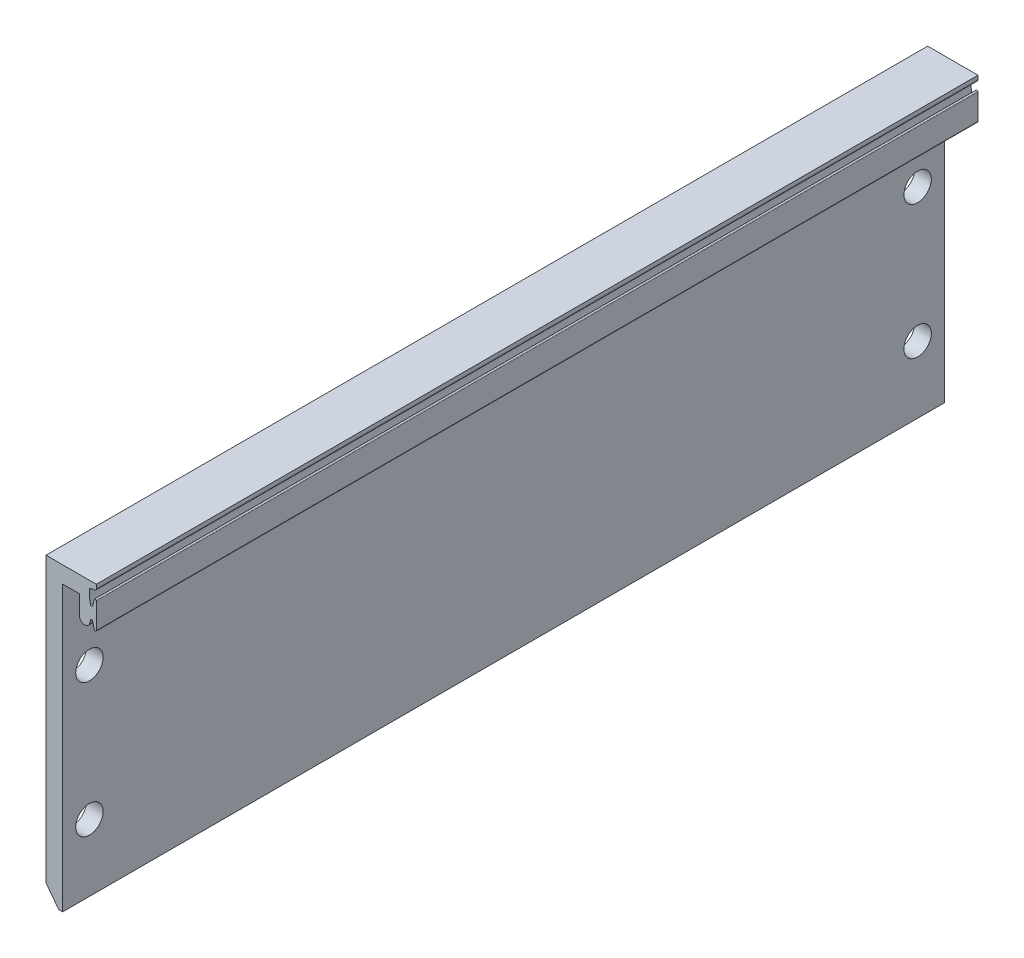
ISO-10303-21;
HEADER;
FILE_DESCRIPTION(('STEP AP214'),'2;1');
FILE_NAME('part.step','',(''),(''),'','','');
FILE_SCHEMA(('AUTOMOTIVE_DESIGN { 1 0 10303 214 1 1 1 1 }'));
ENDSEC;
DATA;
#1=APPLICATION_CONTEXT('core data for automotive mechanical design processes');
#2=APPLICATION_PROTOCOL_DEFINITION('international standard','automotive_design',2000,#1);
#3=PRODUCT_CONTEXT('',#1,'mechanical');
#4=PRODUCT('Part','Part','',(#3));
#5=PRODUCT_RELATED_PRODUCT_CATEGORY('part','',(#4));
#6=PRODUCT_DEFINITION_FORMATION('','',#4);
#7=PRODUCT_DEFINITION_CONTEXT('part definition',#1,'design');
#8=PRODUCT_DEFINITION('design','',#6,#7);
#9=PRODUCT_DEFINITION_SHAPE('','',#8);
#10=(LENGTH_UNIT() NAMED_UNIT(*) SI_UNIT(.MILLI.,.METRE.));
#11=(NAMED_UNIT(*) PLANE_ANGLE_UNIT() SI_UNIT($,.RADIAN.));
#12=(NAMED_UNIT(*) SI_UNIT($,.STERADIAN.) SOLID_ANGLE_UNIT());
#13=UNCERTAINTY_MEASURE_WITH_UNIT(LENGTH_MEASURE(1.E-05),#10,'distance_accuracy_value','');
#14=(GEOMETRIC_REPRESENTATION_CONTEXT(3) GLOBAL_UNCERTAINTY_ASSIGNED_CONTEXT((#13)) GLOBAL_UNIT_ASSIGNED_CONTEXT((#10,
#11,#12)) REPRESENTATION_CONTEXT('',''));
#15=CARTESIAN_POINT('',(0.,0.,0.));
#16=DIRECTION('',(0.,0.,1.));
#17=DIRECTION('',(1.,0.,0.));
#18=AXIS2_PLACEMENT_3D('',#15,#16,#17);
#19=CARTESIAN_POINT('',(540.829442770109,-3340.4171465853,66.));
#20=DIRECTION('',(-0.159823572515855,0.987145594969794,0.));
#21=DIRECTION('',(-0.987145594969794,-0.159823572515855,0.));
#22=AXIS2_PLACEMENT_3D('',#19,#20,#21);
#23=PLANE('',#22);
#24=DIRECTION('',(0.987145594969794,0.159823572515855,0.));
#25=VECTOR('',#24,1.);
#26=CARTESIAN_POINT('',(540.829442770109,-3340.4171465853,-66.));
#27=LINE('',#26,#25);
#28=CARTESIAN_POINT('',(2261.93990029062,-3061.76116775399,-66.));
#29=VERTEX_POINT('',#28);
#30=CARTESIAN_POINT('',(2262.48897943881,-3061.67226922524,-66.));
#31=VERTEX_POINT('',#30);
#32=EDGE_CURVE('E215',#29,#31,#27,.T.);
#33=ORIENTED_EDGE('',*,*,#32,.T.);
#34=DIRECTION('',(0.,0.,-1.));
#35=VECTOR('',#34,1.);
#36=CARTESIAN_POINT('',(2262.48897943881,-3061.67226922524,66.));
#37=LINE('',#36,#35);
#38=CARTESIAN_POINT('',(2262.48897943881,-3061.67226922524,66.));
#39=VERTEX_POINT('',#38);
#40=EDGE_CURVE('E11',#39,#31,#37,.T.);
#41=ORIENTED_EDGE('',*,*,#40,.F.);
#42=DIRECTION('',(0.987145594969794,0.159823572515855,0.));
#43=VECTOR('',#42,1.);
#44=CARTESIAN_POINT('',(540.829442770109,-3340.4171465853,66.));
#45=LINE('',#44,#43);
#46=CARTESIAN_POINT('',(2261.93990029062,-3061.76116775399,66.));
#47=VERTEX_POINT('',#46);
#48=EDGE_CURVE('E263',#47,#39,#45,.T.);
#49=ORIENTED_EDGE('',*,*,#48,.F.);
#50=DIRECTION('',(0.,0.,-1.));
#51=VECTOR('',#50,1.);
#52=CARTESIAN_POINT('',(2261.93990029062,-3061.76116775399,66.));
#53=LINE('',#52,#51);
#54=EDGE_CURVE('E57',#47,#29,#53,.T.);
#55=ORIENTED_EDGE('',*,*,#54,.T.);
#56=EDGE_LOOP('',(#33,#41,#49,#55));
#57=FACE_BOUND('',#56,.T.);
#58=ADVANCED_FACE('F39',(#57),#23,.F.);
#59=CARTESIAN_POINT('',(2262.44103236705,-3061.37612554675,66.));
#60=DIRECTION('',(0.,0.,-1.));
#61=DIRECTION('',(-1.,0.,0.));
#62=AXIS2_PLACEMENT_3D('',#59,#60,#61);
#63=CYLINDRICAL_SURFACE('',#62,0.300000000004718);
#64=CARTESIAN_POINT('',(2262.44103236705,-3061.37612554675,-66.));
#65=DIRECTION('',(0.,0.,1.));
#66=DIRECTION('',(1.,0.,0.));
#67=AXIS2_PLACEMENT_3D('',#64,#65,#66);
#68=CIRCLE('',#67,0.300000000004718);
#69=CARTESIAN_POINT('',(2262.74103236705,-3061.37612554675,-66.));
#70=VERTEX_POINT('',#69);
#71=EDGE_CURVE('E217',#31,#70,#68,.T.);
#72=ORIENTED_EDGE('',*,*,#71,.T.);
#73=DIRECTION('',(0.,0.,-1.));
#74=VECTOR('',#73,1.);
#75=CARTESIAN_POINT('',(2262.74103236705,-3061.37612554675,66.));
#76=LINE('',#75,#74);
#77=CARTESIAN_POINT('',(2262.74103236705,-3061.37612554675,66.));
#78=VERTEX_POINT('',#77);
#79=EDGE_CURVE('E48',#78,#70,#76,.T.);
#80=ORIENTED_EDGE('',*,*,#79,.F.);
#81=CARTESIAN_POINT('',(2262.44103236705,-3061.37612554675,66.));
#82=DIRECTION('',(0.,0.,1.));
#83=DIRECTION('',(1.,0.,0.));
#84=AXIS2_PLACEMENT_3D('',#81,#82,#83);
#85=CIRCLE('',#84,0.300000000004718);
#86=EDGE_CURVE('E134',#39,#78,#85,.T.);
#87=ORIENTED_EDGE('',*,*,#86,.F.);
#88=ORIENTED_EDGE('',*,*,#40,.T.);
#89=EDGE_LOOP('',(#72,#80,#87,#88));
#90=FACE_BOUND('',#89,.T.);
#91=ADVANCED_FACE('F389',(#90),#63,.T.);
#92=CARTESIAN_POINT('',(2262.74103237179,-3.49719947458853E-09,66.));
#93=DIRECTION('',(1.,-1.54555887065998E-12,0.));
#94=DIRECTION('',(1.54555887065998E-12,1.,0.));
#95=AXIS2_PLACEMENT_3D('',#92,#93,#94);
#96=PLANE('',#95);
#97=DIRECTION('',(-1.54555887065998E-12,-1.,0.));
#98=VECTOR('',#97,1.);
#99=CARTESIAN_POINT('',(2262.74103237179,-3.49719947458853E-09,-66.));
#100=LINE('',#99,#98);
#101=CARTESIAN_POINT('',(2262.74103236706,-3060.80146065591,-66.));
#102=VERTEX_POINT('',#101);
#103=EDGE_CURVE('E221',#102,#70,#100,.T.);
#104=ORIENTED_EDGE('',*,*,#103,.F.);
#105=DIRECTION('',(0.,0.,-1.));
#106=VECTOR('',#105,1.);
#107=CARTESIAN_POINT('',(2262.74103236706,-3060.80146065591,66.));
#108=LINE('',#107,#106);
#109=CARTESIAN_POINT('',(2262.74103236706,-3060.80146065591,66.));
#110=VERTEX_POINT('',#109);
#111=EDGE_CURVE('E307',#110,#102,#108,.T.);
#112=ORIENTED_EDGE('',*,*,#111,.F.);
#113=DIRECTION('',(-1.54555887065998E-12,-1.,0.));
#114=VECTOR('',#113,1.);
#115=CARTESIAN_POINT('',(2262.74103237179,-3.49719947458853E-09,66.));
#116=LINE('',#115,#114);
#117=EDGE_CURVE('E335',#110,#78,#116,.T.);
#118=ORIENTED_EDGE('',*,*,#117,.T.);
#119=ORIENTED_EDGE('',*,*,#79,.T.);
#120=EDGE_LOOP('',(#104,#112,#118,#119));
#121=FACE_BOUND('',#120,.T.);
#122=ADVANCED_FACE('F393',(#121),#96,.T.);
#123=CARTESIAN_POINT('',(1.80274390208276E-10,-3060.80146065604,66.));
#124=DIRECTION('',(0.,-1.,0.));
#125=DIRECTION('',(1.,0.,0.));
#126=AXIS2_PLACEMENT_3D('',#123,#124,#125);
#127=PLANE('',#126);
#128=DIRECTION('',(-1.,0.,0.));
#129=VECTOR('',#128,1.);
#130=CARTESIAN_POINT('',(1.80274390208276E-10,-3060.80146065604,-66.));
#131=LINE('',#130,#129);
#132=CARTESIAN_POINT('',(2255.20103236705,-3060.80146065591,-66.));
#133=VERTEX_POINT('',#132);
#134=EDGE_CURVE('E224',#102,#133,#131,.T.);
#135=ORIENTED_EDGE('',*,*,#134,.T.);
#136=DIRECTION('',(0.,0.,-1.));
#137=VECTOR('',#136,1.);
#138=CARTESIAN_POINT('',(2255.20103236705,-3060.80146065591,66.));
#139=LINE('',#138,#137);
#140=CARTESIAN_POINT('',(2255.20103236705,-3060.80146065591,66.));
#141=VERTEX_POINT('',#140);
#142=EDGE_CURVE('E304',#141,#133,#139,.T.);
#143=ORIENTED_EDGE('',*,*,#142,.F.);
#144=DIRECTION('',(-1.,0.,0.));
#145=VECTOR('',#144,1.);
#146=CARTESIAN_POINT('',(1.80274390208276E-10,-3060.80146065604,66.));
#147=LINE('',#146,#145);
#148=EDGE_CURVE('E338',#110,#141,#147,.T.);
#149=ORIENTED_EDGE('',*,*,#148,.F.);
#150=ORIENTED_EDGE('',*,*,#111,.T.);
#151=EDGE_LOOP('',(#135,#143,#149,#150));
#152=FACE_BOUND('',#151,.T.);
#153=ADVANCED_FACE('F405',(#152),#127,.F.);
#154=CARTESIAN_POINT('',(2255.20103236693,9.42598065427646E-11,66.));
#155=DIRECTION('',(1.,0.,0.));
#156=DIRECTION('',(0.,1.,0.));
#157=AXIS2_PLACEMENT_3D('',#154,#155,#156);
#158=PLANE('',#157);
#159=CARTESIAN_POINT('',(2255.20103236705,-3075.80146065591,62.));
#160=DIRECTION('',(-1.,0.,0.));
#161=DIRECTION('',(0.,1.,0.));
#162=AXIS2_PLACEMENT_3D('',#159,#160,#161);
#163=CIRCLE('',#162,2.04999999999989);
#164=CARTESIAN_POINT('',(2255.20103236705,-3073.75146065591,62.));
#165=VERTEX_POINT('',#164);
#166=EDGE_CURVE('E328',#165,#165,#163,.T.);
#167=ORIENTED_EDGE('',*,*,#166,.F.);
#168=EDGE_LOOP('',(#167));
#169=FACE_BOUND('',#168,.T.);
#170=CARTESIAN_POINT('',(2255.20103236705,-3095.80146065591,62.));
#171=DIRECTION('',(-1.,0.,0.));
#172=DIRECTION('',(0.,1.,0.));
#173=AXIS2_PLACEMENT_3D('',#170,#171,#172);
#174=CIRCLE('',#173,2.05);
#175=CARTESIAN_POINT('',(2255.20103236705,-3093.75146065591,62.));
#176=VERTEX_POINT('',#175);
#177=EDGE_CURVE('E318',#176,#176,#174,.T.);
#178=ORIENTED_EDGE('',*,*,#177,.F.);
#179=EDGE_LOOP('',(#178));
#180=FACE_BOUND('',#179,.T.);
#181=CARTESIAN_POINT('',(2255.20103236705,-3095.80146065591,-62.));
#182=DIRECTION('',(-1.,0.,0.));
#183=DIRECTION('',(0.,-1.,0.));
#184=AXIS2_PLACEMENT_3D('',#181,#182,#183);
#185=CIRCLE('',#184,2.05);
#186=CARTESIAN_POINT('',(2255.20103236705,-3097.85146065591,-62.));
#187=VERTEX_POINT('',#186);
#188=EDGE_CURVE('E315',#187,#187,#185,.T.);
#189=ORIENTED_EDGE('',*,*,#188,.F.);
#190=EDGE_LOOP('',(#189));
#191=FACE_BOUND('',#190,.T.);
#192=CARTESIAN_POINT('',(2255.20103236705,-3075.80146065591,-62.));
#193=DIRECTION('',(-1.,0.,0.));
#194=DIRECTION('',(0.,-1.,0.));
#195=AXIS2_PLACEMENT_3D('',#192,#193,#194);
#196=CIRCLE('',#195,2.04999999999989);
#197=CARTESIAN_POINT('',(2255.20103236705,-3077.85146065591,-62.));
#198=VERTEX_POINT('',#197);
#199=EDGE_CURVE('E312',#198,#198,#196,.T.);
#200=ORIENTED_EDGE('',*,*,#199,.F.);
#201=EDGE_LOOP('',(#200));
#202=FACE_BOUND('',#201,.T.);
#203=DIRECTION('',(0.,-1.,0.));
#204=VECTOR('',#203,1.);
#205=CARTESIAN_POINT('',(2255.20103236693,9.42598065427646E-11,-66.));
#206=LINE('',#205,#204);
#207=CARTESIAN_POINT('',(2255.20103236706,-3103.30146065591,-66.));
#208=VERTEX_POINT('',#207);
#209=EDGE_CURVE('E226',#133,#208,#206,.T.);
#210=ORIENTED_EDGE('',*,*,#209,.T.);
#211=DIRECTION('',(0.,0.,-1.));
#212=VECTOR('',#211,1.);
#213=CARTESIAN_POINT('',(2255.20103236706,-3103.30146065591,66.));
#214=LINE('',#213,#212);
#215=CARTESIAN_POINT('',(2255.20103236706,-3103.30146065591,66.));
#216=VERTEX_POINT('',#215);
#217=EDGE_CURVE('E301',#216,#208,#214,.T.);
#218=ORIENTED_EDGE('',*,*,#217,.F.);
#219=DIRECTION('',(0.,-1.,0.));
#220=VECTOR('',#219,1.);
#221=CARTESIAN_POINT('',(2255.20103236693,9.42598065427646E-11,66.));
#222=LINE('',#221,#220);
#223=EDGE_CURVE('E340',#141,#216,#222,.T.);
#224=ORIENTED_EDGE('',*,*,#223,.F.);
#225=ORIENTED_EDGE('',*,*,#142,.T.);
#226=EDGE_LOOP('',(#210,#218,#224,#225));
#227=FACE_BOUND('',#226,.T.);
#228=ADVANCED_FACE('F407',(#169,#180,#191,#202,#227),#158,.F.);
#229=CARTESIAN_POINT('',(-65.4843291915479,-49.7680901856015,66.));
#230=DIRECTION('',(0.796162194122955,0.605083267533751,0.));
#231=DIRECTION('',(-0.605083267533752,0.796162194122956,0.));
#232=AXIS2_PLACEMENT_3D('',#229,#230,#231);
#233=PLANE('',#232);
#234=DIRECTION('',(0.605083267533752,-0.796162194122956,0.));
#235=VECTOR('',#234,1.);
#236=CARTESIAN_POINT('',(-65.4843291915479,-49.7680901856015,-66.));
#237=LINE('',#236,#235);
#238=CARTESIAN_POINT('',(2257.10103236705,-3105.8014606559,-66.));
#239=VERTEX_POINT('',#238);
#240=EDGE_CURVE('E228',#208,#239,#237,.T.);
#241=ORIENTED_EDGE('',*,*,#240,.T.);
#242=DIRECTION('',(0.,0.,-1.));
#243=VECTOR('',#242,1.);
#244=CARTESIAN_POINT('',(2257.10103236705,-3105.8014606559,66.));
#245=LINE('',#244,#243);
#246=CARTESIAN_POINT('',(2257.10103236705,-3105.8014606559,66.));
#247=VERTEX_POINT('',#246);
#248=EDGE_CURVE('E298',#247,#239,#245,.T.);
#249=ORIENTED_EDGE('',*,*,#248,.F.);
#250=DIRECTION('',(0.605083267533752,-0.796162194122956,0.));
#251=VECTOR('',#250,1.);
#252=CARTESIAN_POINT('',(-65.4843291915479,-49.7680901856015,66.));
#253=LINE('',#252,#251);
#254=EDGE_CURVE('E342',#216,#247,#253,.T.);
#255=ORIENTED_EDGE('',*,*,#254,.F.);
#256=ORIENTED_EDGE('',*,*,#217,.T.);
#257=EDGE_LOOP('',(#241,#249,#255,#256));
#258=FACE_BOUND('',#257,.T.);
#259=ADVANCED_FACE('F412',(#258),#233,.F.);
#260=CARTESIAN_POINT('',(0.,-3105.8014606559,66.));
#261=DIRECTION('',(0.,1.,0.));
#262=DIRECTION('',(0.,0.,1.));
#263=AXIS2_PLACEMENT_3D('',#260,#261,#262);
#264=PLANE('',#263);
#265=DIRECTION('',(1.,0.,0.));
#266=VECTOR('',#265,1.);
#267=CARTESIAN_POINT('',(0.,-3105.8014606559,-66.));
#268=LINE('',#267,#266);
#269=CARTESIAN_POINT('',(2257.70103236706,-3105.8014606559,-66.));
#270=VERTEX_POINT('',#269);
#271=EDGE_CURVE('E230',#239,#270,#268,.T.);
#272=ORIENTED_EDGE('',*,*,#271,.T.);
#273=DIRECTION('',(0.,0.,-1.));
#274=VECTOR('',#273,1.);
#275=CARTESIAN_POINT('',(2257.70103236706,-3105.8014606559,66.));
#276=LINE('',#275,#274);
#277=CARTESIAN_POINT('',(2257.70103236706,-3105.8014606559,66.));
#278=VERTEX_POINT('',#277);
#279=EDGE_CURVE('E295',#278,#270,#276,.T.);
#280=ORIENTED_EDGE('',*,*,#279,.F.);
#281=DIRECTION('',(1.,0.,0.));
#282=VECTOR('',#281,1.);
#283=CARTESIAN_POINT('',(0.,-3105.8014606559,66.));
#284=LINE('',#283,#282);
#285=EDGE_CURVE('E344',#247,#278,#284,.T.);
#286=ORIENTED_EDGE('',*,*,#285,.F.);
#287=ORIENTED_EDGE('',*,*,#248,.T.);
#288=EDGE_LOOP('',(#272,#280,#286,#287));
#289=FACE_BOUND('',#288,.T.);
#290=ADVANCED_FACE('F418',(#289),#264,.F.);
#291=CARTESIAN_POINT('',(2257.70103236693,9.43642981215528E-11,66.));
#292=DIRECTION('',(-1.,0.,0.));
#293=DIRECTION('',(0.,-1.,0.));
#294=AXIS2_PLACEMENT_3D('',#291,#292,#293);
#295=PLANE('',#294);
#296=CARTESIAN_POINT('',(2257.70103236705,-3075.80146065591,62.));
#297=DIRECTION('',(-1.,0.,0.));
#298=DIRECTION('',(0.,-1.,0.));
#299=AXIS2_PLACEMENT_3D('',#296,#297,#298);
#300=CIRCLE('',#299,2.04999999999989);
#301=CARTESIAN_POINT('',(2257.70103236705,-3077.85146065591,62.));
#302=VERTEX_POINT('',#301);
#303=EDGE_CURVE('E42',#302,#302,#300,.T.);
#304=ORIENTED_EDGE('',*,*,#303,.T.);
#305=EDGE_LOOP('',(#304));
#306=FACE_BOUND('',#305,.T.);
#307=CARTESIAN_POINT('',(2257.70103236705,-3095.80146065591,62.));
#308=DIRECTION('',(-1.,0.,0.));
#309=DIRECTION('',(0.,-1.,0.));
#310=AXIS2_PLACEMENT_3D('',#307,#308,#309);
#311=CIRCLE('',#310,2.05);
#312=CARTESIAN_POINT('',(2257.70103236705,-3097.85146065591,62.));
#313=VERTEX_POINT('',#312);
#314=EDGE_CURVE('E316',#313,#313,#311,.T.);
#315=ORIENTED_EDGE('',*,*,#314,.T.);
#316=EDGE_LOOP('',(#315));
#317=FACE_BOUND('',#316,.T.);
#318=CARTESIAN_POINT('',(2257.70103236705,-3095.80146065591,-62.));
#319=DIRECTION('',(-1.,0.,0.));
#320=DIRECTION('',(0.,-1.,0.));
#321=AXIS2_PLACEMENT_3D('',#318,#319,#320);
#322=CIRCLE('',#321,2.05);
#323=CARTESIAN_POINT('',(2257.70103236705,-3097.85146065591,-62.));
#324=VERTEX_POINT('',#323);
#325=EDGE_CURVE('E313',#324,#324,#322,.T.);
#326=ORIENTED_EDGE('',*,*,#325,.T.);
#327=EDGE_LOOP('',(#326));
#328=FACE_BOUND('',#327,.T.);
#329=CARTESIAN_POINT('',(2257.70103236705,-3075.80146065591,-62.));
#330=DIRECTION('',(-1.,0.,0.));
#331=DIRECTION('',(0.,-1.,0.));
#332=AXIS2_PLACEMENT_3D('',#329,#330,#331);
#333=CIRCLE('',#332,2.04999999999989);
#334=CARTESIAN_POINT('',(2257.70103236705,-3077.85146065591,-62.));
#335=VERTEX_POINT('',#334);
#336=EDGE_CURVE('E218',#335,#335,#333,.T.);
#337=ORIENTED_EDGE('',*,*,#336,.T.);
#338=EDGE_LOOP('',(#337));
#339=FACE_BOUND('',#338,.T.);
#340=DIRECTION('',(0.,1.,0.));
#341=VECTOR('',#340,1.);
#342=CARTESIAN_POINT('',(2257.70103236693,9.43642981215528E-11,-66.));
#343=LINE('',#342,#341);
#344=CARTESIAN_POINT('',(2257.70103236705,-3063.3014606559,-66.));
#345=VERTEX_POINT('',#344);
#346=EDGE_CURVE('E232',#270,#345,#343,.T.);
#347=ORIENTED_EDGE('',*,*,#346,.T.);
#348=DIRECTION('',(0.,0.,-1.));
#349=VECTOR('',#348,1.);
#350=CARTESIAN_POINT('',(2257.70103236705,-3063.3014606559,66.));
#351=LINE('',#350,#349);
#352=CARTESIAN_POINT('',(2257.70103236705,-3063.3014606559,66.));
#353=VERTEX_POINT('',#352);
#354=EDGE_CURVE('E292',#353,#345,#351,.T.);
#355=ORIENTED_EDGE('',*,*,#354,.F.);
#356=DIRECTION('',(0.,1.,0.));
#357=VECTOR('',#356,1.);
#358=CARTESIAN_POINT('',(2257.70103236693,9.43642981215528E-11,66.));
#359=LINE('',#358,#357);
#360=EDGE_CURVE('E346',#278,#353,#359,.T.);
#361=ORIENTED_EDGE('',*,*,#360,.F.);
#362=ORIENTED_EDGE('',*,*,#279,.T.);
#363=EDGE_LOOP('',(#347,#355,#361,#362));
#364=FACE_BOUND('',#363,.T.);
#365=ADVANCED_FACE('F422',(#306,#317,#328,#339,#364),#295,.F.);
#366=CARTESIAN_POINT('',(-5.44151650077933E-10,-3063.3014606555,66.));
#367=DIRECTION('',(1.77635683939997E-13,1.,0.));
#368=DIRECTION('',(-1.,1.77635683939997E-13,0.));
#369=AXIS2_PLACEMENT_3D('',#366,#367,#368);
#370=PLANE('',#369);
#371=DIRECTION('',(1.,-1.77635683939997E-13,0.));
#372=VECTOR('',#371,1.);
#373=CARTESIAN_POINT('',(-5.44151650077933E-10,-3063.3014606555,-66.));
#374=LINE('',#373,#372);
#375=CARTESIAN_POINT('',(2260.20103236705,-3063.3014606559,-66.));
#376=VERTEX_POINT('',#375);
#377=EDGE_CURVE('E234',#345,#376,#374,.T.);
#378=ORIENTED_EDGE('',*,*,#377,.T.);
#379=DIRECTION('',(0.,0.,-1.));
#380=VECTOR('',#379,1.);
#381=CARTESIAN_POINT('',(2260.20103236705,-3063.3014606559,66.));
#382=LINE('',#381,#380);
#383=CARTESIAN_POINT('',(2260.20103236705,-3063.3014606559,66.));
#384=VERTEX_POINT('',#383);
#385=EDGE_CURVE('E289',#384,#376,#382,.T.);
#386=ORIENTED_EDGE('',*,*,#385,.F.);
#387=DIRECTION('',(1.,-1.77635683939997E-13,0.));
#388=VECTOR('',#387,1.);
#389=CARTESIAN_POINT('',(-5.44151650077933E-10,-3063.3014606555,66.));
#390=LINE('',#389,#388);
#391=EDGE_CURVE('E348',#353,#384,#390,.T.);
#392=ORIENTED_EDGE('',*,*,#391,.F.);
#393=ORIENTED_EDGE('',*,*,#354,.T.);
#394=EDGE_LOOP('',(#378,#386,#392,#393));
#395=FACE_BOUND('',#394,.T.);
#396=ADVANCED_FACE('F427',(#395),#370,.F.);
#397=CARTESIAN_POINT('',(2260.2010323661,7.00369407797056E-10,66.));
#398=DIRECTION('',(1.,3.09870404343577E-13,0.));
#399=DIRECTION('',(-3.09870404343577E-13,1.,0.));
#400=AXIS2_PLACEMENT_3D('',#397,#398,#399);
#401=PLANE('',#400);
#402=DIRECTION('',(3.09870404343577E-13,-1.,0.));
#403=VECTOR('',#402,1.);
#404=CARTESIAN_POINT('',(2260.2010323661,7.00369407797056E-10,-66.));
#405=LINE('',#404,#403);
#406=CARTESIAN_POINT('',(2260.20103236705,-3066.16775058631,-66.));
#407=VERTEX_POINT('',#406);
#408=EDGE_CURVE('E236',#376,#407,#405,.T.);
#409=ORIENTED_EDGE('',*,*,#408,.T.);
#410=DIRECTION('',(0.,0.,-1.));
#411=VECTOR('',#410,1.);
#412=CARTESIAN_POINT('',(2260.20103236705,-3066.16775058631,66.));
#413=LINE('',#412,#411);
#414=CARTESIAN_POINT('',(2260.20103236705,-3066.16775058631,66.));
#415=VERTEX_POINT('',#414);
#416=EDGE_CURVE('E286',#415,#407,#413,.T.);
#417=ORIENTED_EDGE('',*,*,#416,.F.);
#418=DIRECTION('',(3.09870404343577E-13,-1.,0.));
#419=VECTOR('',#418,1.);
#420=CARTESIAN_POINT('',(2260.2010323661,7.00369407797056E-10,66.));
#421=LINE('',#420,#419);
#422=EDGE_CURVE('E350',#384,#415,#421,.T.);
#423=ORIENTED_EDGE('',*,*,#422,.F.);
#424=ORIENTED_EDGE('',*,*,#385,.T.);
#425=EDGE_LOOP('',(#409,#417,#423,#424));
#426=FACE_BOUND('',#425,.T.);
#427=ADVANCED_FACE('F433',(#426),#401,.F.);
#428=CARTESIAN_POINT('',(2260.98474243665,-3066.16775058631,66.));
#429=DIRECTION('',(0.,0.,-1.));
#430=DIRECTION('',(-1.,0.,0.));
#431=AXIS2_PLACEMENT_3D('',#428,#429,#430);
#432=CYLINDRICAL_SURFACE('',#431,0.783710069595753);
#433=CARTESIAN_POINT('',(2260.98474243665,-3066.16775058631,-66.));
#434=DIRECTION('',(0.,0.,1.));
#435=DIRECTION('',(1.,0.,0.));
#436=AXIS2_PLACEMENT_3D('',#433,#434,#435);
#437=CIRCLE('',#436,0.783710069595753);
#438=CARTESIAN_POINT('',(2261.74118201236,-3066.37269116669,-66.));
#439=VERTEX_POINT('',#438);
#440=EDGE_CURVE('E238',#407,#439,#437,.T.);
#441=ORIENTED_EDGE('',*,*,#440,.T.);
#442=DIRECTION('',(0.,0.,-1.));
#443=VECTOR('',#442,1.);
#444=CARTESIAN_POINT('',(2261.74118201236,-3066.37269116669,66.));
#445=LINE('',#444,#443);
#446=CARTESIAN_POINT('',(2261.74118201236,-3066.37269116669,66.));
#447=VERTEX_POINT('',#446);
#448=EDGE_CURVE('E283',#447,#439,#445,.T.);
#449=ORIENTED_EDGE('',*,*,#448,.F.);
#450=CARTESIAN_POINT('',(2260.98474243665,-3066.16775058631,66.));
#451=DIRECTION('',(0.,0.,1.));
#452=DIRECTION('',(1.,0.,0.));
#453=AXIS2_PLACEMENT_3D('',#450,#451,#452);
#454=CIRCLE('',#453,0.783710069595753);
#455=EDGE_CURVE('E352',#415,#447,#454,.T.);
#456=ORIENTED_EDGE('',*,*,#455,.F.);
#457=ORIENTED_EDGE('',*,*,#416,.T.);
#458=EDGE_LOOP('',(#441,#449,#456,#457));
#459=FACE_BOUND('',#458,.T.);
#460=ADVANCED_FACE('F437',(#459),#432,.T.);
#461=CARTESIAN_POINT('',(2881.03366264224,-780.552379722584,66.));
#462=DIRECTION('',(-0.965203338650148,0.261500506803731,0.));
#463=DIRECTION('',(-0.261500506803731,-0.965203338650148,0.));
#464=AXIS2_PLACEMENT_3D('',#461,#462,#463);
#465=PLANE('',#464);
#466=DIRECTION('',(0.261500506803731,0.965203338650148,0.));
#467=VECTOR('',#466,1.);
#468=CARTESIAN_POINT('',(2881.03366264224,-780.552379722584,-66.));
#469=LINE('',#468,#467);
#470=CARTESIAN_POINT('',(2261.88625186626,-3065.83723557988,-66.));
#471=VERTEX_POINT('',#470);
#472=EDGE_CURVE('E240',#439,#471,#469,.T.);
#473=ORIENTED_EDGE('',*,*,#472,.T.);
#474=DIRECTION('',(0.,0.,-1.));
#475=VECTOR('',#474,1.);
#476=CARTESIAN_POINT('',(2261.88625186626,-3065.83723557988,66.));
#477=LINE('',#476,#475);
#478=CARTESIAN_POINT('',(2261.88625186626,-3065.83723557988,66.));
#479=VERTEX_POINT('',#478);
#480=EDGE_CURVE('E281',#479,#471,#477,.T.);
#481=ORIENTED_EDGE('',*,*,#480,.F.);
#482=DIRECTION('',(0.261500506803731,0.965203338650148,0.));
#483=VECTOR('',#482,1.);
#484=CARTESIAN_POINT('',(2881.03366264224,-780.552379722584,66.));
#485=LINE('',#484,#483);
#486=EDGE_CURVE('E354',#447,#479,#485,.T.);
#487=ORIENTED_EDGE('',*,*,#486,.F.);
#488=ORIENTED_EDGE('',*,*,#448,.T.);
#489=EDGE_LOOP('',(#473,#481,#487,#488));
#490=FACE_BOUND('',#489,.T.);
#491=ADVANCED_FACE('F442',(#490),#465,.F.);
#492=CARTESIAN_POINT('',(2262.03103236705,-3065.8764606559,66.));
#493=DIRECTION('',(0.,0.,-1.));
#494=DIRECTION('',(-1.,0.,0.));
#495=AXIS2_PLACEMENT_3D('',#492,#493,#494);
#496=CYLINDRICAL_SURFACE('',#495,0.149999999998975);
#497=CARTESIAN_POINT('',(2262.03103236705,-3065.8764606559,-66.));
#498=DIRECTION('',(0.,0.,1.));
#499=DIRECTION('',(1.,0.,0.));
#500=AXIS2_PLACEMENT_3D('',#497,#498,#499);
#501=CIRCLE('',#500,0.149999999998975);
#502=CARTESIAN_POINT('',(2262.1766483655,-3065.84046091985,-66.));
#503=VERTEX_POINT('',#502);
#504=EDGE_CURVE('E243',#503,#471,#501,.T.);
#505=ORIENTED_EDGE('',*,*,#504,.F.);
#506=DIRECTION('',(0.,0.,-1.));
#507=VECTOR('',#506,1.);
#508=CARTESIAN_POINT('',(2262.1766483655,-3065.84046091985,66.));
#509=LINE('',#508,#507);
#510=CARTESIAN_POINT('',(2262.1766483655,-3065.84046091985,66.));
#511=VERTEX_POINT('',#510);
#512=EDGE_CURVE('E279',#511,#503,#509,.T.);
#513=ORIENTED_EDGE('',*,*,#512,.F.);
#514=CARTESIAN_POINT('',(2262.03103236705,-3065.8764606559,66.));
#515=DIRECTION('',(0.,0.,1.));
#516=DIRECTION('',(1.,0.,0.));
#517=AXIS2_PLACEMENT_3D('',#514,#515,#516);
#518=CIRCLE('',#517,0.149999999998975);
#519=EDGE_CURVE('E356',#511,#479,#518,.T.);
#520=ORIENTED_EDGE('',*,*,#519,.T.);
#521=ORIENTED_EDGE('',*,*,#480,.T.);
#522=EDGE_LOOP('',(#505,#513,#520,#521));
#523=FACE_BOUND('',#522,.T.);
#524=ADVANCED_FACE('F448',(#523),#496,.F.);
#525=CARTESIAN_POINT('',(1417.58574950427,350.460892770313,66.));
#526=DIRECTION('',(0.970773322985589,0.239998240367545,0.));
#527=DIRECTION('',(-0.239998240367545,0.970773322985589,0.));
#528=AXIS2_PLACEMENT_3D('',#525,#526,#527);
#529=PLANE('',#528);
#530=DIRECTION('',(0.239998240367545,-0.970773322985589,0.));
#531=VECTOR('',#530,1.);
#532=CARTESIAN_POINT('',(1417.58574950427,350.460892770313,-66.));
#533=LINE('',#532,#531);
#534=CARTESIAN_POINT('',(2262.42078170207,-3066.82796036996,-66.));
#535=VERTEX_POINT('',#534);
#536=EDGE_CURVE('E246',#503,#535,#533,.T.);
#537=ORIENTED_EDGE('',*,*,#536,.T.);
#538=DIRECTION('',(0.,0.,-1.));
#539=VECTOR('',#538,1.);
#540=CARTESIAN_POINT('',(2262.42078170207,-3066.82796036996,66.));
#541=LINE('',#540,#539);
#542=CARTESIAN_POINT('',(2262.42078170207,-3066.82796036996,66.));
#543=VERTEX_POINT('',#542);
#544=EDGE_CURVE('E276',#543,#535,#541,.T.);
#545=ORIENTED_EDGE('',*,*,#544,.F.);
#546=DIRECTION('',(0.239998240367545,-0.970773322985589,0.));
#547=VECTOR('',#546,1.);
#548=CARTESIAN_POINT('',(1417.58574950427,350.460892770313,66.));
#549=LINE('',#548,#547);
#550=EDGE_CURVE('E359',#511,#543,#549,.T.);
#551=ORIENTED_EDGE('',*,*,#550,.F.);
#552=ORIENTED_EDGE('',*,*,#512,.T.);
#553=EDGE_LOOP('',(#537,#545,#551,#552));
#554=FACE_BOUND('',#553,.T.);
#555=ADVANCED_FACE('F451',(#554),#529,.F.);
#556=CARTESIAN_POINT('',(2262.57853236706,-3066.7889606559,66.));
#557=DIRECTION('',(0.,0.,-1.));
#558=DIRECTION('',(-1.,0.,0.));
#559=AXIS2_PLACEMENT_3D('',#556,#557,#558);
#560=CYLINDRICAL_SURFACE('',#559,0.162500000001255);
#561=CARTESIAN_POINT('',(2262.57853236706,-3066.7889606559,-66.));
#562=DIRECTION('',(0.,0.,1.));
#563=DIRECTION('',(1.,0.,0.));
#564=AXIS2_PLACEMENT_3D('',#561,#562,#563);
#565=CIRCLE('',#564,0.162500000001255);
#566=CARTESIAN_POINT('',(2262.74103236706,-3066.78896065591,-66.));
#567=VERTEX_POINT('',#566);
#568=EDGE_CURVE('E248',#535,#567,#565,.T.);
#569=ORIENTED_EDGE('',*,*,#568,.T.);
#570=DIRECTION('',(0.,0.,-1.));
#571=VECTOR('',#570,1.);
#572=CARTESIAN_POINT('',(2262.74103236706,-3066.78896065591,66.));
#573=LINE('',#572,#571);
#574=CARTESIAN_POINT('',(2262.74103236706,-3066.78896065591,66.));
#575=VERTEX_POINT('',#574);
#576=EDGE_CURVE('E273',#575,#567,#573,.T.);
#577=ORIENTED_EDGE('',*,*,#576,.F.);
#578=CARTESIAN_POINT('',(2262.57853236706,-3066.7889606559,66.));
#579=DIRECTION('',(0.,0.,1.));
#580=DIRECTION('',(1.,0.,0.));
#581=AXIS2_PLACEMENT_3D('',#578,#579,#580);
#582=CIRCLE('',#581,0.162500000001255);
#583=EDGE_CURVE('E361',#543,#575,#582,.T.);
#584=ORIENTED_EDGE('',*,*,#583,.F.);
#585=ORIENTED_EDGE('',*,*,#544,.T.);
#586=EDGE_LOOP('',(#569,#577,#584,#585));
#587=FACE_BOUND('',#586,.T.);
#588=ADVANCED_FACE('F456',(#587),#560,.T.);
#589=CARTESIAN_POINT('',(2262.74103236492,1.57624921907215E-09,66.));
#590=DIRECTION('',(-1.,-6.96610525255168E-13,0.));
#591=DIRECTION('',(6.96610525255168E-13,-1.,0.));
#592=AXIS2_PLACEMENT_3D('',#589,#590,#591);
#593=PLANE('',#592);
#594=DIRECTION('',(-6.96610525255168E-13,1.,0.));
#595=VECTOR('',#594,1.);
#596=CARTESIAN_POINT('',(2262.74103236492,1.57624921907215E-09,-66.));
#597=LINE('',#596,#595);
#598=CARTESIAN_POINT('',(2262.74103236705,-3062.96396065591,-66.));
#599=VERTEX_POINT('',#598);
#600=EDGE_CURVE('E250',#567,#599,#597,.T.);
#601=ORIENTED_EDGE('',*,*,#600,.T.);
#602=DIRECTION('',(0.,0.,-1.));
#603=VECTOR('',#602,1.);
#604=CARTESIAN_POINT('',(2262.74103236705,-3062.96396065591,66.));
#605=LINE('',#604,#603);
#606=CARTESIAN_POINT('',(2262.74103236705,-3062.96396065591,66.));
#607=VERTEX_POINT('',#606);
#608=EDGE_CURVE('E270',#607,#599,#605,.T.);
#609=ORIENTED_EDGE('',*,*,#608,.F.);
#610=DIRECTION('',(-6.96610525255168E-13,1.,0.));
#611=VECTOR('',#610,1.);
#612=CARTESIAN_POINT('',(2262.74103236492,1.57624921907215E-09,66.));
#613=LINE('',#612,#611);
#614=EDGE_CURVE('E363',#575,#607,#613,.T.);
#615=ORIENTED_EDGE('',*,*,#614,.F.);
#616=ORIENTED_EDGE('',*,*,#576,.T.);
#617=EDGE_LOOP('',(#601,#609,#615,#616));
#618=FACE_BOUND('',#617,.T.);
#619=ADVANCED_FACE('F459',(#618),#593,.F.);
#620=CARTESIAN_POINT('',(2262.57853236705,-3062.96396065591,66.));
#621=DIRECTION('',(0.,0.,-1.));
#622=DIRECTION('',(-1.,0.,0.));
#623=AXIS2_PLACEMENT_3D('',#620,#621,#622);
#624=CYLINDRICAL_SURFACE('',#623,0.162499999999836);
#625=CARTESIAN_POINT('',(2262.57853236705,-3062.96396065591,-66.));
#626=DIRECTION('',(0.,0.,1.));
#627=DIRECTION('',(1.,0.,0.));
#628=AXIS2_PLACEMENT_3D('',#625,#626,#627);
#629=CIRCLE('',#628,0.162499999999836);
#630=CARTESIAN_POINT('',(2262.42078170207,-3062.92496094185,-66.));
#631=VERTEX_POINT('',#630);
#632=EDGE_CURVE('E252',#599,#631,#629,.T.);
#633=ORIENTED_EDGE('',*,*,#632,.T.);
#634=DIRECTION('',(0.,0.,-1.));
#635=VECTOR('',#634,1.);
#636=CARTESIAN_POINT('',(2262.42078170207,-3062.92496094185,66.));
#637=LINE('',#636,#635);
#638=CARTESIAN_POINT('',(2262.42078170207,-3062.92496094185,66.));
#639=VERTEX_POINT('',#638);
#640=EDGE_CURVE('E267',#639,#631,#637,.T.);
#641=ORIENTED_EDGE('',*,*,#640,.F.);
#642=CARTESIAN_POINT('',(2262.57853236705,-3062.96396065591,66.));
#643=DIRECTION('',(0.,0.,1.));
#644=DIRECTION('',(1.,0.,0.));
#645=AXIS2_PLACEMENT_3D('',#642,#643,#644);
#646=CIRCLE('',#645,0.162499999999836);
#647=EDGE_CURVE('E365',#607,#639,#646,.T.);
#648=ORIENTED_EDGE('',*,*,#647,.F.);
#649=ORIENTED_EDGE('',*,*,#608,.T.);
#650=EDGE_LOOP('',(#633,#641,#648,#649));
#651=FACE_BOUND('',#650,.T.);
#652=ADVANCED_FACE('F371',(#651),#624,.T.);
#653=CARTESIAN_POINT('',(2845.71942563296,-703.529483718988,66.));
#654=DIRECTION('',(0.97077332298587,-0.239998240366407,0.));
#655=DIRECTION('',(0.239998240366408,0.97077332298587,0.));
#656=AXIS2_PLACEMENT_3D('',#653,#654,#655);
#657=PLANE('',#656);
#658=DIRECTION('',(-0.239998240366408,-0.97077332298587,0.));
#659=VECTOR('',#658,1.);
#660=CARTESIAN_POINT('',(2845.71942563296,-703.529483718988,-66.));
#661=LINE('',#660,#659);
#662=CARTESIAN_POINT('',(2262.1766483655,-3063.91246039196,-66.));
#663=VERTEX_POINT('',#662);
#664=EDGE_CURVE('E254',#631,#663,#661,.T.);
#665=ORIENTED_EDGE('',*,*,#664,.T.);
#666=DIRECTION('',(0.,0.,-1.));
#667=VECTOR('',#666,1.);
#668=CARTESIAN_POINT('',(2262.1766483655,-3063.91246039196,66.));
#669=LINE('',#668,#667);
#670=CARTESIAN_POINT('',(2262.1766483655,-3063.91246039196,66.));
#671=VERTEX_POINT('',#670);
#672=EDGE_CURVE('E198',#671,#663,#669,.T.);
#673=ORIENTED_EDGE('',*,*,#672,.F.);
#674=DIRECTION('',(-0.239998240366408,-0.97077332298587,0.));
#675=VECTOR('',#674,1.);
#676=CARTESIAN_POINT('',(2845.71942563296,-703.529483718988,66.));
#677=LINE('',#676,#675);
#678=EDGE_CURVE('E206',#639,#671,#677,.T.);
#679=ORIENTED_EDGE('',*,*,#678,.F.);
#680=ORIENTED_EDGE('',*,*,#640,.T.);
#681=EDGE_LOOP('',(#665,#673,#679,#680));
#682=FACE_BOUND('',#681,.T.);
#683=ADVANCED_FACE('F375',(#682),#657,.F.);
#684=CARTESIAN_POINT('',(2262.03103236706,-3063.8764606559,66.));
#685=DIRECTION('',(0.,0.,-1.));
#686=DIRECTION('',(-1.,0.,0.));
#687=AXIS2_PLACEMENT_3D('',#684,#685,#686);
#688=CYLINDRICAL_SURFACE('',#687,0.15000000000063);
#689=CARTESIAN_POINT('',(2262.03103236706,-3063.8764606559,-66.));
#690=DIRECTION('',(0.,0.,1.));
#691=DIRECTION('',(1.,0.,0.));
#692=AXIS2_PLACEMENT_3D('',#689,#690,#691);
#693=CIRCLE('',#692,0.15000000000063);
#694=CARTESIAN_POINT('',(2261.88205602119,-3063.89395489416,-66.));
#695=VERTEX_POINT('',#694);
#696=EDGE_CURVE('E194',#695,#663,#693,.T.);
#697=ORIENTED_EDGE('',*,*,#696,.F.);
#698=DIRECTION('',(0.,0.,-1.));
#699=VECTOR('',#698,1.);
#700=CARTESIAN_POINT('',(2261.88205602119,-3063.89395489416,66.));
#701=LINE('',#700,#699);
#702=CARTESIAN_POINT('',(2261.88205602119,-3063.89395489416,66.));
#703=VERTEX_POINT('',#702);
#704=EDGE_CURVE('E189',#703,#695,#701,.T.);
#705=ORIENTED_EDGE('',*,*,#704,.F.);
#706=CARTESIAN_POINT('',(2262.03103236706,-3063.8764606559,66.));
#707=DIRECTION('',(0.,0.,1.));
#708=DIRECTION('',(1.,0.,0.));
#709=AXIS2_PLACEMENT_3D('',#706,#707,#708);
#710=CIRCLE('',#709,0.15000000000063);
#711=EDGE_CURVE('E192',#703,#671,#710,.T.);
#712=ORIENTED_EDGE('',*,*,#711,.T.);
#713=ORIENTED_EDGE('',*,*,#672,.T.);
#714=EDGE_LOOP('',(#697,#705,#712,#713));
#715=FACE_BOUND('',#714,.T.);
#716=ADVANCED_FACE('F191',(#715),#688,.F.);
#717=CARTESIAN_POINT('',(2268.12911712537,-3062.303985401,66.));
#718=DIRECTION('',(0.,0.,-1.));
#719=DIRECTION('',(-1.,0.,0.));
#720=AXIS2_PLACEMENT_3D('',#717,#718,#719);
#721=CYLINDRICAL_SURFACE('',#720,6.44622179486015);
#722=CARTESIAN_POINT('',(2268.12911712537,-3062.303985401,-66.));
#723=DIRECTION('',(0.,0.,1.));
#724=DIRECTION('',(1.,0.,0.));
#725=AXIS2_PLACEMENT_3D('',#722,#723,#724);
#726=CIRCLE('',#725,6.44622179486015);
#727=CARTESIAN_POINT('',(2261.68808907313,-3062.04527115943,-66.));
#728=VERTEX_POINT('',#727);
#729=EDGE_CURVE('E258',#728,#695,#726,.T.);
#730=ORIENTED_EDGE('',*,*,#729,.F.);
#731=DIRECTION('',(0.,0.,-1.));
#732=VECTOR('',#731,1.);
#733=CARTESIAN_POINT('',(2261.68808907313,-3062.04527115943,66.));
#734=LINE('',#733,#732);
#735=CARTESIAN_POINT('',(2261.68808907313,-3062.04527115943,66.));
#736=VERTEX_POINT('',#735);
#737=EDGE_CURVE('E122',#736,#728,#734,.T.);
#738=ORIENTED_EDGE('',*,*,#737,.F.);
#739=CARTESIAN_POINT('',(2268.12911712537,-3062.303985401,66.));
#740=DIRECTION('',(0.,0.,1.));
#741=DIRECTION('',(1.,0.,0.));
#742=AXIS2_PLACEMENT_3D('',#739,#740,#741);
#743=CIRCLE('',#742,6.44622179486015);
#744=EDGE_CURVE('E204',#736,#703,#743,.T.);
#745=ORIENTED_EDGE('',*,*,#744,.T.);
#746=ORIENTED_EDGE('',*,*,#704,.T.);
#747=EDGE_LOOP('',(#730,#738,#745,#746));
#748=FACE_BOUND('',#747,.T.);
#749=ADVANCED_FACE('F209',(#748),#721,.F.);
#750=CARTESIAN_POINT('',(2261.98784736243,-3062.05731143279,66.));
#751=DIRECTION('',(0.,0.,-1.));
#752=DIRECTION('',(-1.,0.,0.));
#753=AXIS2_PLACEMENT_3D('',#750,#751,#752);
#754=CYLINDRICAL_SURFACE('',#753,0.300000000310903);
#755=CARTESIAN_POINT('',(2261.98784736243,-3062.05731143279,-66.));
#756=DIRECTION('',(0.,0.,1.));
#757=DIRECTION('',(1.,0.,0.));
#758=AXIS2_PLACEMENT_3D('',#755,#756,#757);
#759=CIRCLE('',#758,0.300000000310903);
#760=EDGE_CURVE('E260',#29,#728,#759,.T.);
#761=ORIENTED_EDGE('',*,*,#760,.F.);
#762=ORIENTED_EDGE('',*,*,#54,.F.);
#763=CARTESIAN_POINT('',(2261.98784736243,-3062.05731143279,66.));
#764=DIRECTION('',(0.,0.,1.));
#765=DIRECTION('',(1.,0.,0.));
#766=AXIS2_PLACEMENT_3D('',#763,#764,#765);
#767=CIRCLE('',#766,0.300000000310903);
#768=EDGE_CURVE('E210',#47,#736,#767,.T.);
#769=ORIENTED_EDGE('',*,*,#768,.T.);
#770=ORIENTED_EDGE('',*,*,#737,.T.);
#771=EDGE_LOOP('',(#761,#762,#769,#770));
#772=FACE_BOUND('',#771,.T.);
#773=ADVANCED_FACE('F378',(#772),#754,.F.);
#774=CARTESIAN_POINT('',(0.,0.,66.));
#775=DIRECTION('',(0.,0.,1.));
#776=DIRECTION('',(1.,0.,0.));
#777=AXIS2_PLACEMENT_3D('',#774,#775,#776);
#778=PLANE('',#777);
#779=ORIENTED_EDGE('',*,*,#48,.T.);
#780=ORIENTED_EDGE('',*,*,#86,.T.);
#781=ORIENTED_EDGE('',*,*,#117,.F.);
#782=ORIENTED_EDGE('',*,*,#148,.T.);
#783=ORIENTED_EDGE('',*,*,#223,.T.);
#784=ORIENTED_EDGE('',*,*,#254,.T.);
#785=ORIENTED_EDGE('',*,*,#285,.T.);
#786=ORIENTED_EDGE('',*,*,#360,.T.);
#787=ORIENTED_EDGE('',*,*,#391,.T.);
#788=ORIENTED_EDGE('',*,*,#422,.T.);
#789=ORIENTED_EDGE('',*,*,#455,.T.);
#790=ORIENTED_EDGE('',*,*,#486,.T.);
#791=ORIENTED_EDGE('',*,*,#519,.F.);
#792=ORIENTED_EDGE('',*,*,#550,.T.);
#793=ORIENTED_EDGE('',*,*,#583,.T.);
#794=ORIENTED_EDGE('',*,*,#614,.T.);
#795=ORIENTED_EDGE('',*,*,#647,.T.);
#796=ORIENTED_EDGE('',*,*,#678,.T.);
#797=ORIENTED_EDGE('',*,*,#711,.F.);
#798=ORIENTED_EDGE('',*,*,#744,.F.);
#799=ORIENTED_EDGE('',*,*,#768,.F.);
#800=EDGE_LOOP('',(#779,#780,#781,#782,#783,#784,#785,#786,#787,#788,#789,#790,#791,#792,#793,
#794,#795,#796,#797,#798,#799));
#801=FACE_BOUND('',#800,.T.);
#802=ADVANCED_FACE('F202',(#801),#778,.T.);
#803=CARTESIAN_POINT('',(0.,0.,-66.));
#804=DIRECTION('',(0.,0.,1.));
#805=DIRECTION('',(1.,0.,0.));
#806=AXIS2_PLACEMENT_3D('',#803,#804,#805);
#807=PLANE('',#806);
#808=ORIENTED_EDGE('',*,*,#32,.F.);
#809=ORIENTED_EDGE('',*,*,#760,.T.);
#810=ORIENTED_EDGE('',*,*,#729,.T.);
#811=ORIENTED_EDGE('',*,*,#696,.T.);
#812=ORIENTED_EDGE('',*,*,#664,.F.);
#813=ORIENTED_EDGE('',*,*,#632,.F.);
#814=ORIENTED_EDGE('',*,*,#600,.F.);
#815=ORIENTED_EDGE('',*,*,#568,.F.);
#816=ORIENTED_EDGE('',*,*,#536,.F.);
#817=ORIENTED_EDGE('',*,*,#504,.T.);
#818=ORIENTED_EDGE('',*,*,#472,.F.);
#819=ORIENTED_EDGE('',*,*,#440,.F.);
#820=ORIENTED_EDGE('',*,*,#408,.F.);
#821=ORIENTED_EDGE('',*,*,#377,.F.);
#822=ORIENTED_EDGE('',*,*,#346,.F.);
#823=ORIENTED_EDGE('',*,*,#271,.F.);
#824=ORIENTED_EDGE('',*,*,#240,.F.);
#825=ORIENTED_EDGE('',*,*,#209,.F.);
#826=ORIENTED_EDGE('',*,*,#134,.F.);
#827=ORIENTED_EDGE('',*,*,#103,.T.);
#828=ORIENTED_EDGE('',*,*,#71,.F.);
#829=EDGE_LOOP('',(#808,#809,#810,#811,#812,#813,#814,#815,#816,#817,#818,#819,#820,#821,#822,
#823,#824,#825,#826,#827,#828));
#830=FACE_BOUND('',#829,.T.);
#831=ADVANCED_FACE('F377',(#830),#807,.F.);
#832=CARTESIAN_POINT('',(2262.74103236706,-3075.80146065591,-62.));
#833=DIRECTION('',(-1.,0.,0.));
#834=DIRECTION('',(0.,-1.,0.));
#835=AXIS2_PLACEMENT_3D('',#832,#833,#834);
#836=CYLINDRICAL_SURFACE('',#835,2.04999999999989);
#837=ORIENTED_EDGE('',*,*,#199,.T.);
#838=EDGE_LOOP('',(#837));
#839=FACE_BOUND('',#838,.T.);
#840=ORIENTED_EDGE('',*,*,#336,.F.);
#841=EDGE_LOOP('',(#840));
#842=FACE_BOUND('',#841,.T.);
#843=ADVANCED_FACE('F597',(#839,#842),#836,.F.);
#844=CARTESIAN_POINT('',(2262.74103236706,-3095.80146065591,-62.));
#845=DIRECTION('',(-1.,0.,0.));
#846=DIRECTION('',(0.,-1.,0.));
#847=AXIS2_PLACEMENT_3D('',#844,#845,#846);
#848=CYLINDRICAL_SURFACE('',#847,2.05);
#849=ORIENTED_EDGE('',*,*,#188,.T.);
#850=EDGE_LOOP('',(#849));
#851=FACE_BOUND('',#850,.T.);
#852=ORIENTED_EDGE('',*,*,#325,.F.);
#853=EDGE_LOOP('',(#852));
#854=FACE_BOUND('',#853,.T.);
#855=ADVANCED_FACE('F605',(#851,#854),#848,.F.);
#856=CARTESIAN_POINT('',(2262.74103236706,-3095.80146065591,62.));
#857=DIRECTION('',(-1.,0.,0.));
#858=DIRECTION('',(0.,-1.,0.));
#859=AXIS2_PLACEMENT_3D('',#856,#857,#858);
#860=CYLINDRICAL_SURFACE('',#859,2.05);
#861=ORIENTED_EDGE('',*,*,#177,.T.);
#862=EDGE_LOOP('',(#861));
#863=FACE_BOUND('',#862,.T.);
#864=ORIENTED_EDGE('',*,*,#314,.F.);
#865=EDGE_LOOP('',(#864));
#866=FACE_BOUND('',#865,.T.);
#867=ADVANCED_FACE('F612',(#863,#866),#860,.F.);
#868=CARTESIAN_POINT('',(2262.74103236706,-3075.80146065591,62.));
#869=DIRECTION('',(-1.,0.,0.));
#870=DIRECTION('',(0.,-1.,0.));
#871=AXIS2_PLACEMENT_3D('',#868,#869,#870);
#872=CYLINDRICAL_SURFACE('',#871,2.04999999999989);
#873=ORIENTED_EDGE('',*,*,#166,.T.);
#874=EDGE_LOOP('',(#873));
#875=FACE_BOUND('',#874,.T.);
#876=ORIENTED_EDGE('',*,*,#303,.F.);
#877=EDGE_LOOP('',(#876));
#878=FACE_BOUND('',#877,.T.);
#879=ADVANCED_FACE('F620',(#875,#878),#872,.F.);
#880=CLOSED_SHELL('',(#58,#91,#122,#153,#228,#259,#290,#365,#396,#427,#460,#491,#524,#555,#588,
#619,#652,#683,#716,#749,#773,#802,#831,#843,#855,#867,#879));
#881=MANIFOLD_SOLID_BREP('B2',#880);
#882=ADVANCED_BREP_SHAPE_REPRESENTATION('',(#18,#881),#14);
#883=SHAPE_DEFINITION_REPRESENTATION(#9,#882);
ENDSEC;
END-ISO-10303-21;
